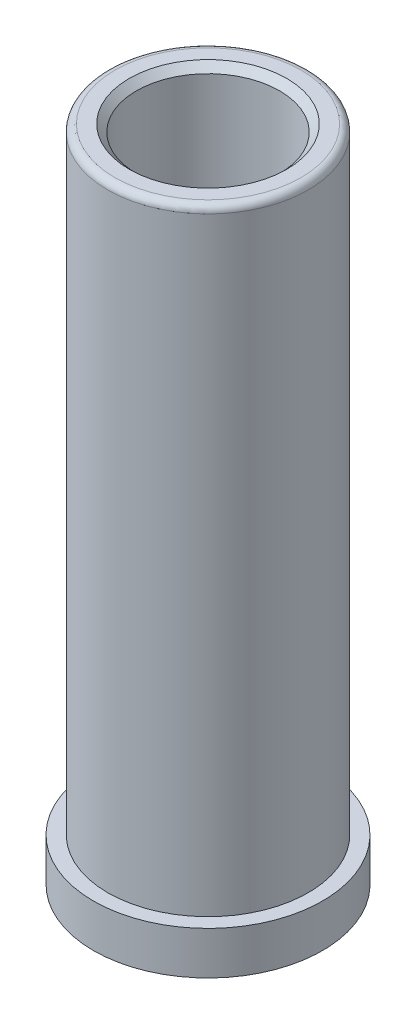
ISO-10303-21;
HEADER;
FILE_DESCRIPTION(('STEP AP214'),'2;1');
FILE_NAME('part.step','',(''),(''),'','','');
FILE_SCHEMA(('AUTOMOTIVE_DESIGN { 1 0 10303 214 1 1 1 1 }'));
ENDSEC;
DATA;
#1=APPLICATION_CONTEXT('core data for automotive mechanical design processes');
#2=APPLICATION_PROTOCOL_DEFINITION('international standard','automotive_design',2000,#1);
#3=PRODUCT_CONTEXT('',#1,'mechanical');
#4=PRODUCT('Part','Part','',(#3));
#5=PRODUCT_RELATED_PRODUCT_CATEGORY('part','',(#4));
#6=PRODUCT_DEFINITION_FORMATION('','',#4);
#7=PRODUCT_DEFINITION_CONTEXT('part definition',#1,'design');
#8=PRODUCT_DEFINITION('design','',#6,#7);
#9=PRODUCT_DEFINITION_SHAPE('','',#8);
#10=(LENGTH_UNIT() NAMED_UNIT(*) SI_UNIT(.MILLI.,.METRE.));
#11=(NAMED_UNIT(*) PLANE_ANGLE_UNIT() SI_UNIT($,.RADIAN.));
#12=(NAMED_UNIT(*) SI_UNIT($,.STERADIAN.) SOLID_ANGLE_UNIT());
#13=UNCERTAINTY_MEASURE_WITH_UNIT(LENGTH_MEASURE(1.E-05),#10,'distance_accuracy_value','');
#14=(GEOMETRIC_REPRESENTATION_CONTEXT(3) GLOBAL_UNCERTAINTY_ASSIGNED_CONTEXT((#13)) GLOBAL_UNIT_ASSIGNED_CONTEXT((#10,
#11,#12)) REPRESENTATION_CONTEXT('',''));
#15=CARTESIAN_POINT('',(0.,0.,0.));
#16=DIRECTION('',(0.,0.,1.));
#17=DIRECTION('',(1.,0.,0.));
#18=AXIS2_PLACEMENT_3D('',#15,#16,#17);
#19=CARTESIAN_POINT('',(0.,0.,0.));
#20=DIRECTION('',(0.,-1.,0.));
#21=DIRECTION('',(0.,0.,-1.));
#22=AXIS2_PLACEMENT_3D('',#19,#20,#21);
#23=CYLINDRICAL_SURFACE('',#22,7.);
#24=CARTESIAN_POINT('',(0.,42.5,0.));
#25=DIRECTION('',(0.,-1.,0.));
#26=DIRECTION('',(0.,0.,-1.));
#27=AXIS2_PLACEMENT_3D('',#24,#25,#26);
#28=CIRCLE('',#27,7.);
#29=CARTESIAN_POINT('',(0.,42.5,-7.));
#30=VERTEX_POINT('',#29);
#31=EDGE_CURVE('E20',#30,#30,#28,.T.);
#32=ORIENTED_EDGE('',*,*,#31,.T.);
#33=EDGE_LOOP('',(#32));
#34=FACE_BOUND('',#33,.T.);
#35=CARTESIAN_POINT('',(0.,0.,0.));
#36=DIRECTION('',(0.,-1.,0.));
#37=DIRECTION('',(0.,0.,-1.));
#38=AXIS2_PLACEMENT_3D('',#35,#36,#37);
#39=CIRCLE('',#38,7.);
#40=CARTESIAN_POINT('',(0.,0.,-7.));
#41=VERTEX_POINT('',#40);
#42=EDGE_CURVE('E48',#41,#41,#39,.T.);
#43=ORIENTED_EDGE('',*,*,#42,.F.);
#44=EDGE_LOOP('',(#43));
#45=FACE_BOUND('',#44,.T.);
#46=ADVANCED_FACE('F13',(#34,#45),#23,.T.);
#47=CARTESIAN_POINT('',(-7.,43.,0.));
#48=DIRECTION('',(0.,-1.,0.));
#49=DIRECTION('',(0.,0.,-1.));
#50=AXIS2_PLACEMENT_3D('',#47,#48,#49);
#51=PLANE('',#50);
#52=CARTESIAN_POINT('',(0.,43.,0.));
#53=DIRECTION('',(0.,-1.,0.));
#54=DIRECTION('',(0.,0.,-1.));
#55=AXIS2_PLACEMENT_3D('',#52,#53,#54);
#56=CIRCLE('',#55,6.5);
#57=CARTESIAN_POINT('',(0.,43.,-6.5));
#58=VERTEX_POINT('',#57);
#59=EDGE_CURVE('E8',#58,#58,#56,.F.);
#60=ORIENTED_EDGE('',*,*,#59,.T.);
#61=EDGE_LOOP('',(#60));
#62=FACE_BOUND('',#61,.T.);
#63=CARTESIAN_POINT('',(0.,43.,0.));
#64=DIRECTION('',(0.,-1.,0.));
#65=DIRECTION('',(0.,0.,-1.));
#66=AXIS2_PLACEMENT_3D('',#63,#64,#65);
#67=CIRCLE('',#66,5.5);
#68=CARTESIAN_POINT('',(0.,43.,-5.5));
#69=VERTEX_POINT('',#68);
#70=EDGE_CURVE('E36',#69,#69,#67,.T.);
#71=ORIENTED_EDGE('',*,*,#70,.T.);
#72=EDGE_LOOP('',(#71));
#73=FACE_BOUND('',#72,.T.);
#74=ADVANCED_FACE('F55',(#62,#73),#51,.F.);
#75=CARTESIAN_POINT('',(0.,0.,0.));
#76=DIRECTION('',(0.,-1.,0.));
#77=DIRECTION('',(0.,0.,-1.));
#78=AXIS2_PLACEMENT_3D('',#75,#76,#77);
#79=CYLINDRICAL_SURFACE('',#78,5.);
#80=CARTESIAN_POINT('',(0.,42.5,0.));
#81=DIRECTION('',(0.,-1.,0.));
#82=DIRECTION('',(0.,0.,-1.));
#83=AXIS2_PLACEMENT_3D('',#80,#81,#82);
#84=CIRCLE('',#83,5.);
#85=CARTESIAN_POINT('',(0.,42.5,-5.));
#86=VERTEX_POINT('',#85);
#87=EDGE_CURVE('E33',#86,#86,#84,.F.);
#88=ORIENTED_EDGE('',*,*,#87,.T.);
#89=EDGE_LOOP('',(#88));
#90=FACE_BOUND('',#89,.T.);
#91=CARTESIAN_POINT('',(0.,-3.,0.));
#92=DIRECTION('',(0.,-1.,0.));
#93=DIRECTION('',(0.,0.,-1.));
#94=AXIS2_PLACEMENT_3D('',#91,#92,#93);
#95=CIRCLE('',#94,5.);
#96=CARTESIAN_POINT('',(0.,-3.,-5.));
#97=VERTEX_POINT('',#96);
#98=EDGE_CURVE('E39',#97,#97,#95,.T.);
#99=ORIENTED_EDGE('',*,*,#98,.T.);
#100=EDGE_LOOP('',(#99));
#101=FACE_BOUND('',#100,.T.);
#102=ADVANCED_FACE('F62',(#90,#101),#79,.F.);
#103=CARTESIAN_POINT('',(0.,-3.15,0.));
#104=DIRECTION('',(0.,-1.,0.));
#105=DIRECTION('',(0.,0.,-1.));
#106=AXIS2_PLACEMENT_3D('',#103,#104,#105);
#107=CONICAL_SURFACE('',#106,5.1,0.588002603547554);
#108=CARTESIAN_POINT('',(0.,-3.36,0.));
#109=DIRECTION('',(0.,1.,0.));
#110=DIRECTION('',(0.,0.,1.));
#111=AXIS2_PLACEMENT_3D('',#108,#109,#110);
#112=CIRCLE('',#111,5.24);
#113=CARTESIAN_POINT('',(0.,-3.36,5.24));
#114=VERTEX_POINT('',#113);
#115=EDGE_CURVE('E24',#114,#114,#112,.F.);
#116=ORIENTED_EDGE('',*,*,#115,.T.);
#117=EDGE_LOOP('',(#116));
#118=FACE_BOUND('',#117,.T.);
#119=ORIENTED_EDGE('',*,*,#98,.F.);
#120=EDGE_LOOP('',(#119));
#121=FACE_BOUND('',#120,.T.);
#122=ADVANCED_FACE('F81',(#118,#121),#107,.F.);
#123=CARTESIAN_POINT('',(-5.1,-3.,0.));
#124=DIRECTION('',(0.,1.,0.));
#125=DIRECTION('',(0.,0.,1.));
#126=AXIS2_PLACEMENT_3D('',#123,#124,#125);
#127=PLANE('',#126);
#128=CARTESIAN_POINT('',(0.,-3.,0.));
#129=DIRECTION('',(0.,1.,0.));
#130=DIRECTION('',(0.,0.,1.));
#131=AXIS2_PLACEMENT_3D('',#128,#129,#130);
#132=CIRCLE('',#131,5.6);
#133=CARTESIAN_POINT('',(0.,-3.,5.6));
#134=VERTEX_POINT('',#133);
#135=EDGE_CURVE('E28',#134,#134,#132,.T.);
#136=ORIENTED_EDGE('',*,*,#135,.T.);
#137=EDGE_LOOP('',(#136));
#138=FACE_BOUND('',#137,.T.);
#139=CARTESIAN_POINT('',(0.,-3.,0.));
#140=DIRECTION('',(0.,-1.,0.));
#141=DIRECTION('',(0.,0.,-1.));
#142=AXIS2_PLACEMENT_3D('',#139,#140,#141);
#143=CIRCLE('',#142,8.);
#144=CARTESIAN_POINT('',(0.,-3.,-8.));
#145=VERTEX_POINT('',#144);
#146=EDGE_CURVE('E42',#145,#145,#143,.T.);
#147=ORIENTED_EDGE('',*,*,#146,.T.);
#148=EDGE_LOOP('',(#147));
#149=FACE_BOUND('',#148,.T.);
#150=ADVANCED_FACE('F84',(#138,#149),#127,.F.);
#151=CARTESIAN_POINT('',(0.,0.,0.));
#152=DIRECTION('',(0.,-1.,0.));
#153=DIRECTION('',(0.,0.,-1.));
#154=AXIS2_PLACEMENT_3D('',#151,#152,#153);
#155=CYLINDRICAL_SURFACE('',#154,8.);
#156=ORIENTED_EDGE('',*,*,#146,.F.);
#157=EDGE_LOOP('',(#156));
#158=FACE_BOUND('',#157,.T.);
#159=CARTESIAN_POINT('',(0.,0.,0.));
#160=DIRECTION('',(0.,-1.,0.));
#161=DIRECTION('',(0.,0.,-1.));
#162=AXIS2_PLACEMENT_3D('',#159,#160,#161);
#163=CIRCLE('',#162,8.);
#164=CARTESIAN_POINT('',(0.,0.,-8.));
#165=VERTEX_POINT('',#164);
#166=EDGE_CURVE('E45',#165,#165,#163,.T.);
#167=ORIENTED_EDGE('',*,*,#166,.T.);
#168=EDGE_LOOP('',(#167));
#169=FACE_BOUND('',#168,.T.);
#170=ADVANCED_FACE('F96',(#158,#169),#155,.T.);
#171=CARTESIAN_POINT('',(-8.,0.,0.));
#172=DIRECTION('',(0.,-1.,0.));
#173=DIRECTION('',(0.,0.,-1.));
#174=AXIS2_PLACEMENT_3D('',#171,#172,#173);
#175=PLANE('',#174);
#176=ORIENTED_EDGE('',*,*,#166,.F.);
#177=EDGE_LOOP('',(#176));
#178=FACE_BOUND('',#177,.T.);
#179=ORIENTED_EDGE('',*,*,#42,.T.);
#180=EDGE_LOOP('',(#179));
#181=FACE_BOUND('',#180,.T.);
#182=ADVANCED_FACE('F52',(#178,#181),#175,.F.);
#183=CARTESIAN_POINT('',(0.,43.,0.));
#184=DIRECTION('',(0.,1.,0.));
#185=DIRECTION('',(0.,0.,1.));
#186=AXIS2_PLACEMENT_3D('',#183,#184,#185);
#187=CONICAL_SURFACE('',#186,5.5,0.785398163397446);
#188=ORIENTED_EDGE('',*,*,#87,.F.);
#189=EDGE_LOOP('',(#188));
#190=FACE_BOUND('',#189,.T.);
#191=ORIENTED_EDGE('',*,*,#70,.F.);
#192=EDGE_LOOP('',(#191));
#193=FACE_BOUND('',#192,.T.);
#194=ADVANCED_FACE('F66',(#190,#193),#187,.F.);
#195=CARTESIAN_POINT('',(0.,-3.5,0.));
#196=DIRECTION('',(0.,1.,0.));
#197=DIRECTION('',(0.,0.,1.));
#198=AXIS2_PLACEMENT_3D('',#195,#196,#197);
#199=CONICAL_SURFACE('',#198,5.1,0.785398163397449);
#200=ORIENTED_EDGE('',*,*,#135,.F.);
#201=EDGE_LOOP('',(#200));
#202=FACE_BOUND('',#201,.T.);
#203=ORIENTED_EDGE('',*,*,#115,.F.);
#204=EDGE_LOOP('',(#203));
#205=FACE_BOUND('',#204,.T.);
#206=ADVANCED_FACE('F68',(#202,#205),#199,.T.);
#207=CARTESIAN_POINT('',(0.,42.5,0.));
#208=DIRECTION('',(0.,-1.,0.));
#209=DIRECTION('',(0.,0.,-1.));
#210=AXIS2_PLACEMENT_3D('',#207,#208,#209);
#211=TOROIDAL_SURFACE('',#210,6.5,0.5);
#212=ORIENTED_EDGE('',*,*,#59,.F.);
#213=EDGE_LOOP('',(#212));
#214=FACE_BOUND('',#213,.T.);
#215=ORIENTED_EDGE('',*,*,#31,.F.);
#216=EDGE_LOOP('',(#215));
#217=FACE_BOUND('',#216,.T.);
#218=ADVANCED_FACE('F15',(#214,#217),#211,.T.);
#219=CLOSED_SHELL('',(#46,#74,#102,#122,#150,#170,#182,#194,#206,#218));
#220=MANIFOLD_SOLID_BREP('B1',#219);
#221=ADVANCED_BREP_SHAPE_REPRESENTATION('',(#18,#220),#14);
#222=SHAPE_DEFINITION_REPRESENTATION(#9,#221);
ENDSEC;
END-ISO-10303-21;
